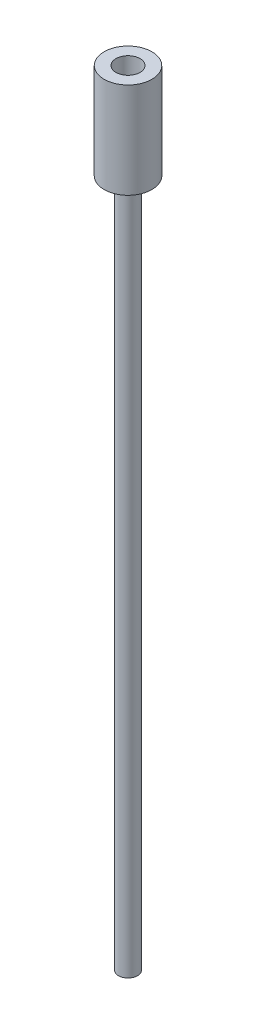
ISO-10303-21;
HEADER;
FILE_DESCRIPTION(('STEP AP214'),'2;1');
FILE_NAME('part.step','',(''),(''),'','','');
FILE_SCHEMA(('AUTOMOTIVE_DESIGN { 1 0 10303 214 1 1 1 1 }'));
ENDSEC;
DATA;
#1=APPLICATION_CONTEXT('core data for automotive mechanical design processes');
#2=APPLICATION_PROTOCOL_DEFINITION('international standard','automotive_design',2000,#1);
#3=PRODUCT_CONTEXT('',#1,'mechanical');
#4=PRODUCT('Part','Part','',(#3));
#5=PRODUCT_RELATED_PRODUCT_CATEGORY('part','',(#4));
#6=PRODUCT_DEFINITION_FORMATION('','',#4);
#7=PRODUCT_DEFINITION_CONTEXT('part definition',#1,'design');
#8=PRODUCT_DEFINITION('design','',#6,#7);
#9=PRODUCT_DEFINITION_SHAPE('','',#8);
#10=(LENGTH_UNIT() NAMED_UNIT(*) SI_UNIT(.MILLI.,.METRE.));
#11=(NAMED_UNIT(*) PLANE_ANGLE_UNIT() SI_UNIT($,.RADIAN.));
#12=(NAMED_UNIT(*) SI_UNIT($,.STERADIAN.) SOLID_ANGLE_UNIT());
#13=UNCERTAINTY_MEASURE_WITH_UNIT(LENGTH_MEASURE(1.E-05),#10,'distance_accuracy_value','');
#14=(GEOMETRIC_REPRESENTATION_CONTEXT(3) GLOBAL_UNCERTAINTY_ASSIGNED_CONTEXT((#13)) GLOBAL_UNIT_ASSIGNED_CONTEXT((#10,
#11,#12)) REPRESENTATION_CONTEXT('',''));
#15=CARTESIAN_POINT('',(0.,0.,0.));
#16=DIRECTION('',(0.,0.,1.));
#17=DIRECTION('',(1.,0.,0.));
#18=AXIS2_PLACEMENT_3D('',#15,#16,#17);
#19=CARTESIAN_POINT('',(0.,31.75,0.));
#20=DIRECTION('',(0.,1.,0.));
#21=DIRECTION('',(0.,0.,1.));
#22=AXIS2_PLACEMENT_3D('',#19,#20,#21);
#23=PLANE('',#22);
#24=CARTESIAN_POINT('',(0.,31.75,0.));
#25=DIRECTION('',(0.,1.,0.));
#26=DIRECTION('',(1.,0.,0.));
#27=AXIS2_PLACEMENT_3D('',#24,#25,#26);
#28=CIRCLE('',#27,7.9375);
#29=CARTESIAN_POINT('',(7.9375,31.75,0.));
#30=VERTEX_POINT('',#29);
#31=EDGE_CURVE('E68',#30,#30,#28,.T.);
#32=ORIENTED_EDGE('',*,*,#31,.T.);
#33=EDGE_LOOP('',(#32));
#34=FACE_BOUND('',#33,.T.);
#35=CARTESIAN_POINT('',(0.,31.75,0.));
#36=DIRECTION('',(0.,1.,0.));
#37=DIRECTION('',(0.,0.,1.));
#38=AXIS2_PLACEMENT_3D('',#35,#36,#37);
#39=CIRCLE('',#38,4.000000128);
#40=CARTESIAN_POINT('',(0.,31.75,4.000000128));
#41=VERTEX_POINT('',#40);
#42=EDGE_CURVE('E84',#41,#41,#39,.T.);
#43=ORIENTED_EDGE('',*,*,#42,.F.);
#44=EDGE_LOOP('',(#43));
#45=FACE_BOUND('',#44,.T.);
#46=ADVANCED_FACE('F60',(#34,#45),#23,.T.);
#47=CARTESIAN_POINT('',(0.,-228.6,0.));
#48=DIRECTION('',(0.,1.,0.));
#49=DIRECTION('',(0.,0.,1.));
#50=AXIS2_PLACEMENT_3D('',#47,#48,#49);
#51=CYLINDRICAL_SURFACE('',#50,3.175);
#52=CARTESIAN_POINT('',(0.,-228.6,0.));
#53=DIRECTION('',(0.,1.,0.));
#54=DIRECTION('',(0.,0.,1.));
#55=AXIS2_PLACEMENT_3D('',#52,#53,#54);
#56=CIRCLE('',#55,3.175);
#57=CARTESIAN_POINT('',(0.,-228.6,3.175));
#58=VERTEX_POINT('',#57);
#59=EDGE_CURVE('E11',#58,#58,#56,.T.);
#60=ORIENTED_EDGE('',*,*,#59,.T.);
#61=EDGE_LOOP('',(#60));
#62=FACE_BOUND('',#61,.T.);
#63=CARTESIAN_POINT('',(0.,0.,0.));
#64=DIRECTION('',(0.,1.,0.));
#65=DIRECTION('',(0.,0.,1.));
#66=AXIS2_PLACEMENT_3D('',#63,#64,#65);
#67=CIRCLE('',#66,3.175);
#68=CARTESIAN_POINT('',(0.,0.,3.175));
#69=VERTEX_POINT('',#68);
#70=EDGE_CURVE('E79',#69,#69,#67,.T.);
#71=ORIENTED_EDGE('',*,*,#70,.F.);
#72=EDGE_LOOP('',(#71));
#73=FACE_BOUND('',#72,.T.);
#74=ADVANCED_FACE('F62',(#62,#73),#51,.T.);
#75=CARTESIAN_POINT('',(0.,-228.6,0.));
#76=DIRECTION('',(0.,1.,0.));
#77=DIRECTION('',(0.,0.,1.));
#78=AXIS2_PLACEMENT_3D('',#75,#76,#77);
#79=PLANE('',#78);
#80=ORIENTED_EDGE('',*,*,#59,.F.);
#81=EDGE_LOOP('',(#80));
#82=FACE_BOUND('',#81,.T.);
#83=ADVANCED_FACE('F103',(#82),#79,.F.);
#84=CARTESIAN_POINT('',(0.,0.,0.));
#85=DIRECTION('',(0.,1.,0.));
#86=DIRECTION('',(0.,0.,1.));
#87=AXIS2_PLACEMENT_3D('',#84,#85,#86);
#88=PLANE('',#87);
#89=CARTESIAN_POINT('',(0.,0.,0.));
#90=DIRECTION('',(0.,1.,0.));
#91=DIRECTION('',(1.,0.,0.));
#92=AXIS2_PLACEMENT_3D('',#89,#90,#91);
#93=CIRCLE('',#92,7.9375);
#94=CARTESIAN_POINT('',(7.9375,0.,0.));
#95=VERTEX_POINT('',#94);
#96=EDGE_CURVE('E73',#95,#95,#93,.T.);
#97=ORIENTED_EDGE('',*,*,#96,.F.);
#98=EDGE_LOOP('',(#97));
#99=FACE_BOUND('',#98,.T.);
#100=ORIENTED_EDGE('',*,*,#70,.T.);
#101=EDGE_LOOP('',(#100));
#102=FACE_BOUND('',#101,.T.);
#103=ADVANCED_FACE('F106',(#99,#102),#88,.F.);
#104=CARTESIAN_POINT('',(0.,31.75,0.));
#105=DIRECTION('',(0.,-1.,0.));
#106=DIRECTION('',(0.,0.,-1.));
#107=AXIS2_PLACEMENT_3D('',#104,#105,#106);
#108=CYLINDRICAL_SURFACE('',#107,7.9375);
#109=ORIENTED_EDGE('',*,*,#31,.F.);
#110=EDGE_LOOP('',(#109));
#111=FACE_BOUND('',#110,.T.);
#112=ORIENTED_EDGE('',*,*,#96,.T.);
#113=EDGE_LOOP('',(#112));
#114=FACE_BOUND('',#113,.T.);
#115=ADVANCED_FACE('F109',(#111,#114),#108,.T.);
#116=CARTESIAN_POINT('',(0.,31.75,0.));
#117=DIRECTION('',(0.,-1.,0.));
#118=DIRECTION('',(0.,0.,-1.));
#119=AXIS2_PLACEMENT_3D('',#116,#117,#118);
#120=CYLINDRICAL_SURFACE('',#119,4.000000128);
#121=ORIENTED_EDGE('',*,*,#42,.T.);
#122=EDGE_LOOP('',(#121));
#123=FACE_BOUND('',#122,.T.);
#124=CARTESIAN_POINT('',(0.,6.35,0.));
#125=DIRECTION('',(0.,1.,0.));
#126=DIRECTION('',(0.,0.,1.));
#127=AXIS2_PLACEMENT_3D('',#124,#125,#126);
#128=CIRCLE('',#127,4.000000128);
#129=CARTESIAN_POINT('',(0.,6.35,4.000000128));
#130=VERTEX_POINT('',#129);
#131=EDGE_CURVE('E85',#130,#130,#128,.T.);
#132=ORIENTED_EDGE('',*,*,#131,.F.);
#133=EDGE_LOOP('',(#132));
#134=FACE_BOUND('',#133,.T.);
#135=ADVANCED_FACE('F93',(#123,#134),#120,.F.);
#136=CARTESIAN_POINT('',(0.,6.35,0.));
#137=DIRECTION('',(0.,1.,0.));
#138=DIRECTION('',(0.,0.,1.));
#139=AXIS2_PLACEMENT_3D('',#136,#137,#138);
#140=PLANE('',#139);
#141=ORIENTED_EDGE('',*,*,#131,.T.);
#142=EDGE_LOOP('',(#141));
#143=FACE_BOUND('',#142,.T.);
#144=ADVANCED_FACE('F114',(#143),#140,.T.);
#145=CLOSED_SHELL('',(#46,#74,#83,#103,#115,#135,#144));
#146=MANIFOLD_SOLID_BREP('B2',#145);
#147=ADVANCED_BREP_SHAPE_REPRESENTATION('',(#18,#146),#14);
#148=SHAPE_DEFINITION_REPRESENTATION(#9,#147);
ENDSEC;
END-ISO-10303-21;
